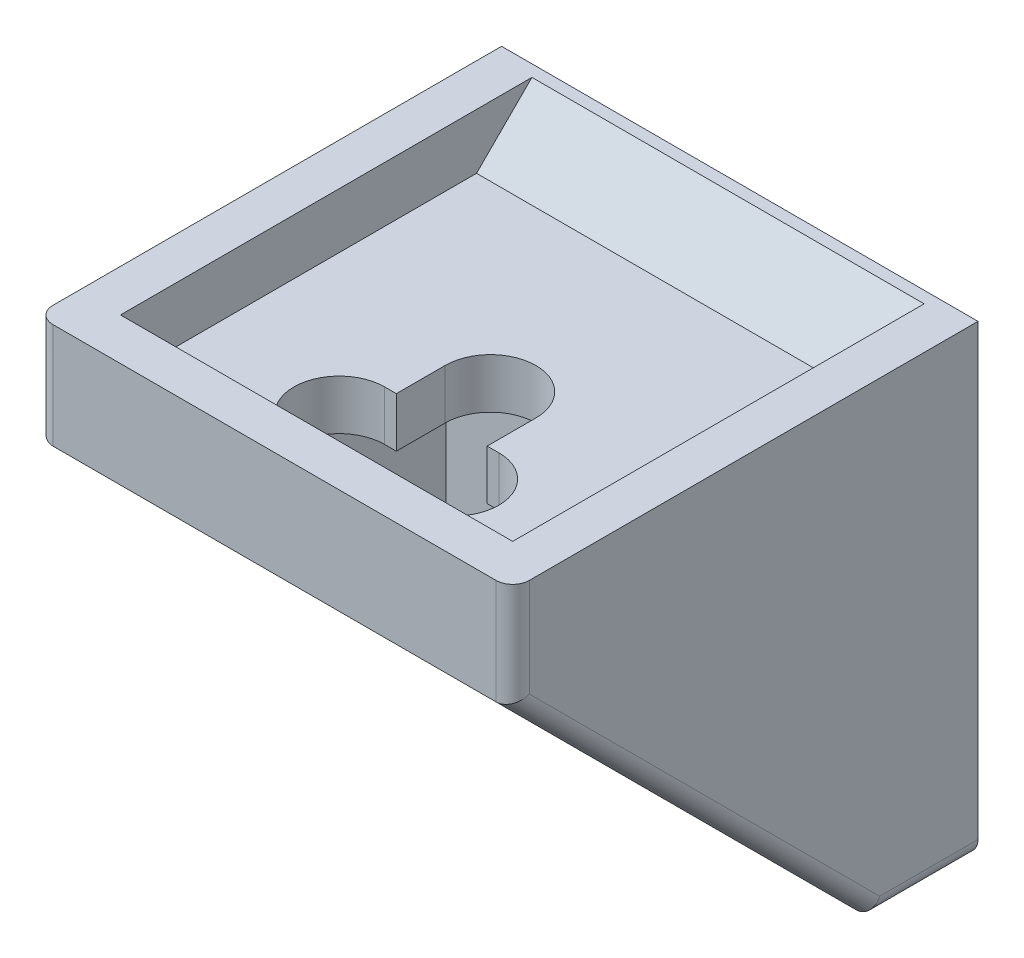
ISO-10303-21;
HEADER;
FILE_DESCRIPTION(('STEP AP214'),'2;1');
FILE_NAME('part.step','',(''),(''),'','','');
FILE_SCHEMA(('AUTOMOTIVE_DESIGN { 1 0 10303 214 1 1 1 1 }'));
ENDSEC;
DATA;
#1=APPLICATION_CONTEXT('core data for automotive mechanical design processes');
#2=APPLICATION_PROTOCOL_DEFINITION('international standard','automotive_design',2000,#1);
#3=PRODUCT_CONTEXT('',#1,'mechanical');
#4=PRODUCT('Part','Part','',(#3));
#5=PRODUCT_RELATED_PRODUCT_CATEGORY('part','',(#4));
#6=PRODUCT_DEFINITION_FORMATION('','',#4);
#7=PRODUCT_DEFINITION_CONTEXT('part definition',#1,'design');
#8=PRODUCT_DEFINITION('design','',#6,#7);
#9=PRODUCT_DEFINITION_SHAPE('','',#8);
#10=(LENGTH_UNIT() NAMED_UNIT(*) SI_UNIT(.MILLI.,.METRE.));
#11=(NAMED_UNIT(*) PLANE_ANGLE_UNIT() SI_UNIT($,.RADIAN.));
#12=(NAMED_UNIT(*) SI_UNIT($,.STERADIAN.) SOLID_ANGLE_UNIT());
#13=UNCERTAINTY_MEASURE_WITH_UNIT(LENGTH_MEASURE(1.E-05),#10,'distance_accuracy_value','');
#14=(GEOMETRIC_REPRESENTATION_CONTEXT(3) GLOBAL_UNCERTAINTY_ASSIGNED_CONTEXT((#13)) GLOBAL_UNIT_ASSIGNED_CONTEXT((#10,
#11,#12)) REPRESENTATION_CONTEXT('',''));
#15=CARTESIAN_POINT('',(0.,0.,0.));
#16=DIRECTION('',(0.,0.,1.));
#17=DIRECTION('',(1.,0.,0.));
#18=AXIS2_PLACEMENT_3D('',#15,#16,#17);
#19=CARTESIAN_POINT('',(4.1,-9.5,26.9));
#20=DIRECTION('',(0.,0.,-1.));
#21=DIRECTION('',(-1.,0.,0.));
#22=AXIS2_PLACEMENT_3D('',#19,#20,#21);
#23=PLANE('',#22);
#24=DIRECTION('',(-1.,0.,0.));
#25=VECTOR('',#24,1.);
#26=CARTESIAN_POINT('',(4.1,-5.,26.9));
#27=LINE('',#26,#25);
#28=CARTESIAN_POINT('',(4.1,-5.,26.9));
#29=VERTEX_POINT('',#28);
#30=CARTESIAN_POINT('',(5.15,-5.,26.9));
#31=VERTEX_POINT('',#30);
#32=EDGE_CURVE('E292',#29,#31,#27,.F.);
#33=ORIENTED_EDGE('',*,*,#32,.F.);
#34=DIRECTION('',(0.,1.,0.));
#35=VECTOR('',#34,1.);
#36=CARTESIAN_POINT('',(4.1,-9.5,26.9));
#37=LINE('',#36,#35);
#38=CARTESIAN_POINT('',(4.1,-9.5,26.9));
#39=VERTEX_POINT('',#38);
#40=EDGE_CURVE('E262',#29,#39,#37,.F.);
#41=ORIENTED_EDGE('',*,*,#40,.T.);
#42=DIRECTION('',(-1.,0.,0.));
#43=VECTOR('',#42,1.);
#44=CARTESIAN_POINT('',(4.1,-9.5,26.9));
#45=LINE('',#44,#43);
#46=CARTESIAN_POINT('',(5.15,-9.5,26.9));
#47=VERTEX_POINT('',#46);
#48=EDGE_CURVE('E296',#47,#39,#45,.T.);
#49=ORIENTED_EDGE('',*,*,#48,.F.);
#50=DIRECTION('',(0.,1.,0.));
#51=VECTOR('',#50,1.);
#52=CARTESIAN_POINT('',(5.15,-9.5,26.9));
#53=LINE('',#52,#51);
#54=EDGE_CURVE('E185',#47,#31,#53,.T.);
#55=ORIENTED_EDGE('',*,*,#54,.T.);
#56=EDGE_LOOP('',(#33,#41,#49,#55));
#57=FACE_BOUND('',#56,.T.);
#58=ADVANCED_FACE('F15',(#57),#23,.F.);
#59=CARTESIAN_POINT('',(-5.15,-9.5,26.9));
#60=DIRECTION('',(0.,0.,-1.));
#61=DIRECTION('',(-1.,0.,0.));
#62=AXIS2_PLACEMENT_3D('',#59,#60,#61);
#63=PLANE('',#62);
#64=DIRECTION('',(-1.,0.,0.));
#65=VECTOR('',#64,1.);
#66=CARTESIAN_POINT('',(-5.15,-5.,26.9));
#67=LINE('',#66,#65);
#68=CARTESIAN_POINT('',(-5.15,-5.,26.9));
#69=VERTEX_POINT('',#68);
#70=CARTESIAN_POINT('',(-4.1,-5.,26.9));
#71=VERTEX_POINT('',#70);
#72=EDGE_CURVE('E279',#69,#71,#67,.F.);
#73=ORIENTED_EDGE('',*,*,#72,.F.);
#74=DIRECTION('',(0.,1.,0.));
#75=VECTOR('',#74,1.);
#76=CARTESIAN_POINT('',(-5.15,-9.5,26.9));
#77=LINE('',#76,#75);
#78=CARTESIAN_POINT('',(-5.15,-9.5,26.9));
#79=VERTEX_POINT('',#78);
#80=EDGE_CURVE('E250',#69,#79,#77,.F.);
#81=ORIENTED_EDGE('',*,*,#80,.T.);
#82=DIRECTION('',(-1.,0.,0.));
#83=VECTOR('',#82,1.);
#84=CARTESIAN_POINT('',(-5.15,-9.5,26.9));
#85=LINE('',#84,#83);
#86=CARTESIAN_POINT('',(-4.1,-9.5,26.9));
#87=VERTEX_POINT('',#86);
#88=EDGE_CURVE('E288',#87,#79,#85,.T.);
#89=ORIENTED_EDGE('',*,*,#88,.F.);
#90=DIRECTION('',(0.,1.,0.));
#91=VECTOR('',#90,1.);
#92=CARTESIAN_POINT('',(-4.1,-9.5,26.9));
#93=LINE('',#92,#91);
#94=EDGE_CURVE('E255',#87,#71,#93,.T.);
#95=ORIENTED_EDGE('',*,*,#94,.T.);
#96=EDGE_LOOP('',(#73,#81,#89,#95));
#97=FACE_BOUND('',#96,.T.);
#98=ADVANCED_FACE('F650',(#97),#63,.F.);
#99=CARTESIAN_POINT('',(5.15,-26.9,9.5));
#100=DIRECTION('',(0.,1.,0.));
#101=DIRECTION('',(0.,0.,1.));
#102=AXIS2_PLACEMENT_3D('',#99,#100,#101);
#103=PLANE('',#102);
#104=DIRECTION('',(1.,0.,0.));
#105=VECTOR('',#104,1.);
#106=CARTESIAN_POINT('',(5.15,-26.9,5.));
#107=LINE('',#106,#105);
#108=CARTESIAN_POINT('',(5.15,-26.9,5.));
#109=VERTEX_POINT('',#108);
#110=CARTESIAN_POINT('',(4.1,-26.9,5.));
#111=VERTEX_POINT('',#110);
#112=EDGE_CURVE('E271',#109,#111,#107,.F.);
#113=ORIENTED_EDGE('',*,*,#112,.F.);
#114=DIRECTION('',(0.,0.,-1.));
#115=VECTOR('',#114,1.);
#116=CARTESIAN_POINT('',(5.15,-26.9,9.5));
#117=LINE('',#116,#115);
#118=CARTESIAN_POINT('',(5.15,-26.9,9.5));
#119=VERTEX_POINT('',#118);
#120=EDGE_CURVE('E236',#109,#119,#117,.F.);
#121=ORIENTED_EDGE('',*,*,#120,.T.);
#122=DIRECTION('',(1.,0.,0.));
#123=VECTOR('',#122,1.);
#124=CARTESIAN_POINT('',(5.15,-26.9,9.5));
#125=LINE('',#124,#123);
#126=CARTESIAN_POINT('',(4.1,-26.9,9.5));
#127=VERTEX_POINT('',#126);
#128=EDGE_CURVE('E277',#127,#119,#125,.T.);
#129=ORIENTED_EDGE('',*,*,#128,.F.);
#130=DIRECTION('',(0.,0.,-1.));
#131=VECTOR('',#130,1.);
#132=CARTESIAN_POINT('',(4.1,-26.9,9.5));
#133=LINE('',#132,#131);
#134=EDGE_CURVE('E233',#127,#111,#133,.T.);
#135=ORIENTED_EDGE('',*,*,#134,.T.);
#136=EDGE_LOOP('',(#113,#121,#129,#135));
#137=FACE_BOUND('',#136,.T.);
#138=ADVANCED_FACE('F795',(#137),#103,.F.);
#139=CARTESIAN_POINT('',(-4.1,-26.9,9.5));
#140=DIRECTION('',(0.,1.,0.));
#141=DIRECTION('',(0.,0.,1.));
#142=AXIS2_PLACEMENT_3D('',#139,#140,#141);
#143=PLANE('',#142);
#144=DIRECTION('',(1.,0.,0.));
#145=VECTOR('',#144,1.);
#146=CARTESIAN_POINT('',(-4.1,-26.9,5.));
#147=LINE('',#146,#145);
#148=CARTESIAN_POINT('',(-4.1,-26.9,5.));
#149=VERTEX_POINT('',#148);
#150=CARTESIAN_POINT('',(-5.15,-26.9,5.));
#151=VERTEX_POINT('',#150);
#152=EDGE_CURVE('E195',#149,#151,#147,.F.);
#153=ORIENTED_EDGE('',*,*,#152,.F.);
#154=DIRECTION('',(0.,0.,1.));
#155=VECTOR('',#154,1.);
#156=CARTESIAN_POINT('',(-4.1,-26.9,9.5));
#157=LINE('',#156,#155);
#158=CARTESIAN_POINT('',(-4.1,-26.9,9.5));
#159=VERTEX_POINT('',#158);
#160=EDGE_CURVE('E224',#149,#159,#157,.T.);
#161=ORIENTED_EDGE('',*,*,#160,.T.);
#162=DIRECTION('',(1.,0.,0.));
#163=VECTOR('',#162,1.);
#164=CARTESIAN_POINT('',(-4.1,-26.9,9.5));
#165=LINE('',#164,#163);
#166=CARTESIAN_POINT('',(-5.15,-26.9,9.5));
#167=VERTEX_POINT('',#166);
#168=EDGE_CURVE('E268',#167,#159,#165,.T.);
#169=ORIENTED_EDGE('',*,*,#168,.F.);
#170=DIRECTION('',(0.,0.,-1.));
#171=VECTOR('',#170,1.);
#172=CARTESIAN_POINT('',(-5.15,-26.9,9.5));
#173=LINE('',#172,#171);
#174=EDGE_CURVE('E219',#167,#151,#173,.T.);
#175=ORIENTED_EDGE('',*,*,#174,.T.);
#176=EDGE_LOOP('',(#153,#161,#169,#175));
#177=FACE_BOUND('',#176,.T.);
#178=ADVANCED_FACE('F791',(#177),#143,.F.);
#179=CARTESIAN_POINT('',(5.15,-9.5,35.1));
#180=DIRECTION('',(0.,0.,1.));
#181=DIRECTION('',(1.,0.,0.));
#182=AXIS2_PLACEMENT_3D('',#179,#180,#181);
#183=PLANE('',#182);
#184=DIRECTION('',(1.,0.,0.));
#185=VECTOR('',#184,1.);
#186=CARTESIAN_POINT('',(-17.7,-5.,35.1));
#187=LINE('',#186,#185);
#188=CARTESIAN_POINT('',(-5.15,-5.,35.1));
#189=VERTEX_POINT('',#188);
#190=CARTESIAN_POINT('',(5.15,-5.,35.1));
#191=VERTEX_POINT('',#190);
#192=EDGE_CURVE('E187',#189,#191,#187,.T.);
#193=ORIENTED_EDGE('',*,*,#192,.T.);
#194=DIRECTION('',(0.,1.,0.));
#195=VECTOR('',#194,1.);
#196=CARTESIAN_POINT('',(5.15,-9.5,35.1));
#197=LINE('',#196,#195);
#198=CARTESIAN_POINT('',(5.15,-9.5,35.1));
#199=VERTEX_POINT('',#198);
#200=EDGE_CURVE('E182',#191,#199,#197,.F.);
#201=ORIENTED_EDGE('',*,*,#200,.T.);
#202=DIRECTION('',(1.,0.,0.));
#203=VECTOR('',#202,1.);
#204=CARTESIAN_POINT('',(-17.,-9.5,35.1));
#205=LINE('',#204,#203);
#206=CARTESIAN_POINT('',(-5.15,-9.5,35.1));
#207=VERTEX_POINT('',#206);
#208=EDGE_CURVE('E194',#199,#207,#205,.F.);
#209=ORIENTED_EDGE('',*,*,#208,.T.);
#210=DIRECTION('',(0.,1.,0.));
#211=VECTOR('',#210,1.);
#212=CARTESIAN_POINT('',(-5.15,-9.5,35.1));
#213=LINE('',#212,#211);
#214=EDGE_CURVE('E241',#207,#189,#213,.T.);
#215=ORIENTED_EDGE('',*,*,#214,.T.);
#216=EDGE_LOOP('',(#193,#201,#209,#215));
#217=FACE_BOUND('',#216,.T.);
#218=ADVANCED_FACE('F192',(#217),#183,.F.);
#219=CARTESIAN_POINT('',(5.15,-9.5,31.));
#220=DIRECTION('',(0.,1.,0.));
#221=DIRECTION('',(0.,0.,1.));
#222=AXIS2_PLACEMENT_3D('',#219,#220,#221);
#223=CYLINDRICAL_SURFACE('',#222,4.1);
#224=CARTESIAN_POINT('',(5.15,-5.,31.));
#225=DIRECTION('',(0.,1.,0.));
#226=DIRECTION('',(0.,0.,1.));
#227=AXIS2_PLACEMENT_3D('',#224,#225,#226);
#228=CIRCLE('',#227,4.1);
#229=EDGE_CURVE('E366',#191,#31,#228,.T.);
#230=ORIENTED_EDGE('',*,*,#229,.T.);
#231=ORIENTED_EDGE('',*,*,#54,.F.);
#232=CARTESIAN_POINT('',(5.15,-9.5,31.));
#233=DIRECTION('',(0.,1.,0.));
#234=DIRECTION('',(0.,0.,1.));
#235=AXIS2_PLACEMENT_3D('',#232,#233,#234);
#236=CIRCLE('',#235,4.1);
#237=EDGE_CURVE('E178',#47,#199,#236,.F.);
#238=ORIENTED_EDGE('',*,*,#237,.T.);
#239=ORIENTED_EDGE('',*,*,#200,.F.);
#240=EDGE_LOOP('',(#230,#231,#238,#239));
#241=FACE_BOUND('',#240,.T.);
#242=ADVANCED_FACE('F181',(#241),#223,.F.);
#243=CARTESIAN_POINT('',(4.1,-9.5,22.5));
#244=DIRECTION('',(1.,0.,0.));
#245=DIRECTION('',(0.,0.,-1.));
#246=AXIS2_PLACEMENT_3D('',#243,#244,#245);
#247=PLANE('',#246);
#248=DIRECTION('',(0.,0.,-1.));
#249=VECTOR('',#248,1.);
#250=CARTESIAN_POINT('',(4.1,-5.,6.06066017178));
#251=LINE('',#250,#249);
#252=CARTESIAN_POINT('',(4.1,-5.,22.5));
#253=VERTEX_POINT('',#252);
#254=EDGE_CURVE('E365',#29,#253,#251,.T.);
#255=ORIENTED_EDGE('',*,*,#254,.T.);
#256=DIRECTION('',(0.,1.,0.));
#257=VECTOR('',#256,1.);
#258=CARTESIAN_POINT('',(4.1,-9.5,22.5));
#259=LINE('',#258,#257);
#260=CARTESIAN_POINT('',(4.1,-9.5,22.5));
#261=VERTEX_POINT('',#260);
#262=EDGE_CURVE('E258',#253,#261,#259,.F.);
#263=ORIENTED_EDGE('',*,*,#262,.T.);
#264=DIRECTION('',(0.,0.,1.));
#265=VECTOR('',#264,1.);
#266=CARTESIAN_POINT('',(4.1,-9.5,42.));
#267=LINE('',#266,#265);
#268=EDGE_CURVE('E188',#261,#39,#267,.T.);
#269=ORIENTED_EDGE('',*,*,#268,.T.);
#270=ORIENTED_EDGE('',*,*,#40,.F.);
#271=EDGE_LOOP('',(#255,#263,#269,#270));
#272=FACE_BOUND('',#271,.T.);
#273=ADVANCED_FACE('F639',(#272),#247,.F.);
#274=CARTESIAN_POINT('',(0.,-9.5,22.5));
#275=DIRECTION('',(0.,1.,0.));
#276=DIRECTION('',(0.,0.,1.));
#277=AXIS2_PLACEMENT_3D('',#274,#275,#276);
#278=CYLINDRICAL_SURFACE('',#277,4.1);
#279=CARTESIAN_POINT('',(0.,-5.,22.5));
#280=DIRECTION('',(0.,1.,0.));
#281=DIRECTION('',(0.,0.,1.));
#282=AXIS2_PLACEMENT_3D('',#279,#280,#281);
#283=CIRCLE('',#282,4.1);
#284=CARTESIAN_POINT('',(-4.1,-5.,22.5));
#285=VERTEX_POINT('',#284);
#286=EDGE_CURVE('E362',#253,#285,#283,.T.);
#287=ORIENTED_EDGE('',*,*,#286,.T.);
#288=DIRECTION('',(0.,1.,0.));
#289=VECTOR('',#288,1.);
#290=CARTESIAN_POINT('',(-4.1,-9.5,22.5));
#291=LINE('',#290,#289);
#292=CARTESIAN_POINT('',(-4.1,-9.5,22.5));
#293=VERTEX_POINT('',#292);
#294=EDGE_CURVE('E253',#285,#293,#291,.F.);
#295=ORIENTED_EDGE('',*,*,#294,.T.);
#296=CARTESIAN_POINT('',(0.,-9.5,22.5));
#297=DIRECTION('',(0.,1.,0.));
#298=DIRECTION('',(0.,0.,1.));
#299=AXIS2_PLACEMENT_3D('',#296,#297,#298);
#300=CIRCLE('',#299,4.1);
#301=EDGE_CURVE('E367',#293,#261,#300,.F.);
#302=ORIENTED_EDGE('',*,*,#301,.T.);
#303=ORIENTED_EDGE('',*,*,#262,.F.);
#304=EDGE_LOOP('',(#287,#295,#302,#303));
#305=FACE_BOUND('',#304,.T.);
#306=ADVANCED_FACE('F641',(#305),#278,.F.);
#307=CARTESIAN_POINT('',(-4.1,-9.5,26.9));
#308=DIRECTION('',(-1.,0.,0.));
#309=DIRECTION('',(0.,0.,1.));
#310=AXIS2_PLACEMENT_3D('',#307,#308,#309);
#311=PLANE('',#310);
#312=DIRECTION('',(0.,0.,-1.));
#313=VECTOR('',#312,1.);
#314=CARTESIAN_POINT('',(-4.1,-5.,6.06066017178));
#315=LINE('',#314,#313);
#316=EDGE_CURVE('E361',#285,#71,#315,.F.);
#317=ORIENTED_EDGE('',*,*,#316,.T.);
#318=ORIENTED_EDGE('',*,*,#94,.F.);
#319=DIRECTION('',(0.,0.,1.));
#320=VECTOR('',#319,1.);
#321=CARTESIAN_POINT('',(-4.1,-9.5,42.));
#322=LINE('',#321,#320);
#323=EDGE_CURVE('E201',#87,#293,#322,.F.);
#324=ORIENTED_EDGE('',*,*,#323,.T.);
#325=ORIENTED_EDGE('',*,*,#294,.F.);
#326=EDGE_LOOP('',(#317,#318,#324,#325));
#327=FACE_BOUND('',#326,.T.);
#328=ADVANCED_FACE('F647',(#327),#311,.F.);
#329=CARTESIAN_POINT('',(-5.15,-9.5,31.));
#330=DIRECTION('',(0.,1.,0.));
#331=DIRECTION('',(0.,0.,1.));
#332=AXIS2_PLACEMENT_3D('',#329,#330,#331);
#333=CYLINDRICAL_SURFACE('',#332,4.1);
#334=CARTESIAN_POINT('',(-5.15,-5.,31.));
#335=DIRECTION('',(0.,1.,0.));
#336=DIRECTION('',(0.,0.,1.));
#337=AXIS2_PLACEMENT_3D('',#334,#335,#336);
#338=CIRCLE('',#337,4.1);
#339=EDGE_CURVE('E358',#69,#189,#338,.T.);
#340=ORIENTED_EDGE('',*,*,#339,.T.);
#341=ORIENTED_EDGE('',*,*,#214,.F.);
#342=CARTESIAN_POINT('',(-5.15,-9.5,31.));
#343=DIRECTION('',(0.,1.,0.));
#344=DIRECTION('',(0.,0.,1.));
#345=AXIS2_PLACEMENT_3D('',#342,#343,#344);
#346=CIRCLE('',#345,4.1);
#347=EDGE_CURVE('E18',#207,#79,#346,.F.);
#348=ORIENTED_EDGE('',*,*,#347,.T.);
#349=ORIENTED_EDGE('',*,*,#80,.F.);
#350=EDGE_LOOP('',(#340,#341,#348,#349));
#351=FACE_BOUND('',#350,.T.);
#352=ADVANCED_FACE('F652',(#351),#333,.F.);
#353=CARTESIAN_POINT('',(5.15,-31.,9.5));
#354=DIRECTION('',(0.,0.,-1.));
#355=DIRECTION('',(-1.,0.,0.));
#356=AXIS2_PLACEMENT_3D('',#353,#354,#355);
#357=CYLINDRICAL_SURFACE('',#356,4.1);
#358=CARTESIAN_POINT('',(5.15,-31.,9.5));
#359=DIRECTION('',(0.,0.,-1.));
#360=DIRECTION('',(-1.,0.,0.));
#361=AXIS2_PLACEMENT_3D('',#358,#359,#360);
#362=CIRCLE('',#361,4.1);
#363=CARTESIAN_POINT('',(5.15,-35.1,9.5));
#364=VERTEX_POINT('',#363);
#365=EDGE_CURVE('E343',#364,#119,#362,.F.);
#366=ORIENTED_EDGE('',*,*,#365,.T.);
#367=ORIENTED_EDGE('',*,*,#120,.F.);
#368=CARTESIAN_POINT('',(5.15,-31.,5.));
#369=DIRECTION('',(0.,0.,-1.));
#370=DIRECTION('',(-1.,0.,0.));
#371=AXIS2_PLACEMENT_3D('',#368,#369,#370);
#372=CIRCLE('',#371,4.1);
#373=CARTESIAN_POINT('',(5.15,-35.1,5.));
#374=VERTEX_POINT('',#373);
#375=EDGE_CURVE('E355',#109,#374,#372,.T.);
#376=ORIENTED_EDGE('',*,*,#375,.T.);
#377=DIRECTION('',(0.,0.,-1.));
#378=VECTOR('',#377,1.);
#379=CARTESIAN_POINT('',(5.15,-35.1,9.5));
#380=LINE('',#379,#378);
#381=EDGE_CURVE('E211',#374,#364,#380,.F.);
#382=ORIENTED_EDGE('',*,*,#381,.T.);
#383=EDGE_LOOP('',(#366,#367,#376,#382));
#384=FACE_BOUND('',#383,.T.);
#385=ADVANCED_FACE('F654',(#384),#357,.F.);
#386=CARTESIAN_POINT('',(4.1,-26.9,9.5));
#387=DIRECTION('',(1.,0.,0.));
#388=DIRECTION('',(0.,0.,-1.));
#389=AXIS2_PLACEMENT_3D('',#386,#387,#388);
#390=PLANE('',#389);
#391=DIRECTION('',(0.,1.,0.));
#392=VECTOR('',#391,1.);
#393=CARTESIAN_POINT('',(4.1,-38.2,5.));
#394=LINE('',#393,#392);
#395=CARTESIAN_POINT('',(4.1,-22.5,5.));
#396=VERTEX_POINT('',#395);
#397=EDGE_CURVE('E349',#396,#111,#394,.F.);
#398=ORIENTED_EDGE('',*,*,#397,.T.);
#399=ORIENTED_EDGE('',*,*,#134,.F.);
#400=DIRECTION('',(0.,1.,0.));
#401=VECTOR('',#400,1.);
#402=CARTESIAN_POINT('',(4.1,-9.5,9.5));
#403=LINE('',#402,#401);
#404=CARTESIAN_POINT('',(4.1,-22.5,9.5));
#405=VERTEX_POINT('',#404);
#406=EDGE_CURVE('E342',#127,#405,#403,.T.);
#407=ORIENTED_EDGE('',*,*,#406,.T.);
#408=DIRECTION('',(0.,0.,-1.));
#409=VECTOR('',#408,1.);
#410=CARTESIAN_POINT('',(4.1,-22.5,9.5));
#411=LINE('',#410,#409);
#412=EDGE_CURVE('E227',#405,#396,#411,.T.);
#413=ORIENTED_EDGE('',*,*,#412,.T.);
#414=EDGE_LOOP('',(#398,#399,#407,#413));
#415=FACE_BOUND('',#414,.T.);
#416=ADVANCED_FACE('F661',(#415),#390,.F.);
#417=CARTESIAN_POINT('',(0.,-22.5,9.5));
#418=DIRECTION('',(0.,0.,-1.));
#419=DIRECTION('',(-1.,0.,0.));
#420=AXIS2_PLACEMENT_3D('',#417,#418,#419);
#421=CYLINDRICAL_SURFACE('',#420,4.1);
#422=CARTESIAN_POINT('',(0.,-22.5,5.));
#423=DIRECTION('',(0.,0.,-1.));
#424=DIRECTION('',(-1.,0.,0.));
#425=AXIS2_PLACEMENT_3D('',#422,#423,#424);
#426=CIRCLE('',#425,4.1);
#427=CARTESIAN_POINT('',(-4.1,-22.5,5.));
#428=VERTEX_POINT('',#427);
#429=EDGE_CURVE('E346',#428,#396,#426,.T.);
#430=ORIENTED_EDGE('',*,*,#429,.T.);
#431=ORIENTED_EDGE('',*,*,#412,.F.);
#432=CARTESIAN_POINT('',(0.,-22.5,9.5));
#433=DIRECTION('',(0.,0.,-1.));
#434=DIRECTION('',(-1.,0.,0.));
#435=AXIS2_PLACEMENT_3D('',#432,#433,#434);
#436=CIRCLE('',#435,4.1);
#437=CARTESIAN_POINT('',(-4.1,-22.5,9.5));
#438=VERTEX_POINT('',#437);
#439=EDGE_CURVE('E339',#405,#438,#436,.F.);
#440=ORIENTED_EDGE('',*,*,#439,.T.);
#441=DIRECTION('',(0.,0.,1.));
#442=VECTOR('',#441,1.);
#443=CARTESIAN_POINT('',(-4.1,-22.5,9.5));
#444=LINE('',#443,#442);
#445=EDGE_CURVE('E225',#438,#428,#444,.F.);
#446=ORIENTED_EDGE('',*,*,#445,.T.);
#447=EDGE_LOOP('',(#430,#431,#440,#446));
#448=FACE_BOUND('',#447,.T.);
#449=ADVANCED_FACE('F768',(#448),#421,.F.);
#450=CARTESIAN_POINT('',(-4.1,-22.5,9.5));
#451=DIRECTION('',(-1.,0.,0.));
#452=DIRECTION('',(0.,0.,1.));
#453=AXIS2_PLACEMENT_3D('',#450,#451,#452);
#454=PLANE('',#453);
#455=DIRECTION('',(0.,1.,0.));
#456=VECTOR('',#455,1.);
#457=CARTESIAN_POINT('',(-4.1,-38.2,5.));
#458=LINE('',#457,#456);
#459=EDGE_CURVE('E350',#149,#428,#458,.T.);
#460=ORIENTED_EDGE('',*,*,#459,.T.);
#461=ORIENTED_EDGE('',*,*,#445,.F.);
#462=DIRECTION('',(0.,1.,0.));
#463=VECTOR('',#462,1.);
#464=CARTESIAN_POINT('',(-4.1,-9.5,9.5));
#465=LINE('',#464,#463);
#466=EDGE_CURVE('E338',#438,#159,#465,.F.);
#467=ORIENTED_EDGE('',*,*,#466,.T.);
#468=ORIENTED_EDGE('',*,*,#160,.F.);
#469=EDGE_LOOP('',(#460,#461,#467,#468));
#470=FACE_BOUND('',#469,.T.);
#471=ADVANCED_FACE('F764',(#470),#454,.F.);
#472=CARTESIAN_POINT('',(-5.15,-31.,9.5));
#473=DIRECTION('',(0.,0.,-1.));
#474=DIRECTION('',(-1.,0.,0.));
#475=AXIS2_PLACEMENT_3D('',#472,#473,#474);
#476=CYLINDRICAL_SURFACE('',#475,4.1);
#477=CARTESIAN_POINT('',(-5.15,-31.,9.5));
#478=DIRECTION('',(0.,0.,-1.));
#479=DIRECTION('',(-1.,0.,0.));
#480=AXIS2_PLACEMENT_3D('',#477,#478,#479);
#481=CIRCLE('',#480,4.1);
#482=CARTESIAN_POINT('',(-5.15,-35.1,9.5));
#483=VERTEX_POINT('',#482);
#484=EDGE_CURVE('E334',#167,#483,#481,.F.);
#485=ORIENTED_EDGE('',*,*,#484,.T.);
#486=DIRECTION('',(0.,0.,-1.));
#487=VECTOR('',#486,1.);
#488=CARTESIAN_POINT('',(-5.15,-35.1,9.5));
#489=LINE('',#488,#487);
#490=CARTESIAN_POINT('',(-5.15,-35.1,5.));
#491=VERTEX_POINT('',#490);
#492=EDGE_CURVE('E216',#483,#491,#489,.T.);
#493=ORIENTED_EDGE('',*,*,#492,.T.);
#494=CARTESIAN_POINT('',(-5.15,-31.,5.));
#495=DIRECTION('',(0.,0.,-1.));
#496=DIRECTION('',(-1.,0.,0.));
#497=AXIS2_PLACEMENT_3D('',#494,#495,#496);
#498=CIRCLE('',#497,4.1);
#499=EDGE_CURVE('E351',#491,#151,#498,.T.);
#500=ORIENTED_EDGE('',*,*,#499,.T.);
#501=ORIENTED_EDGE('',*,*,#174,.F.);
#502=EDGE_LOOP('',(#485,#493,#500,#501));
#503=FACE_BOUND('',#502,.T.);
#504=ADVANCED_FACE('F760',(#503),#476,.F.);
#505=CARTESIAN_POINT('',(-5.15,-35.1,9.5));
#506=DIRECTION('',(0.,-1.,0.));
#507=DIRECTION('',(0.,0.,-1.));
#508=AXIS2_PLACEMENT_3D('',#505,#506,#507);
#509=PLANE('',#508);
#510=DIRECTION('',(1.,0.,0.));
#511=VECTOR('',#510,1.);
#512=CARTESIAN_POINT('',(-17.7,-35.1,5.));
#513=LINE('',#512,#511);
#514=EDGE_CURVE('E354',#374,#491,#513,.F.);
#515=ORIENTED_EDGE('',*,*,#514,.T.);
#516=ORIENTED_EDGE('',*,*,#492,.F.);
#517=DIRECTION('',(-1.,0.,0.));
#518=VECTOR('',#517,1.);
#519=CARTESIAN_POINT('',(-17.,-35.1,9.5));
#520=LINE('',#519,#518);
#521=EDGE_CURVE('E337',#483,#364,#520,.F.);
#522=ORIENTED_EDGE('',*,*,#521,.T.);
#523=ORIENTED_EDGE('',*,*,#381,.F.);
#524=EDGE_LOOP('',(#515,#516,#522,#523));
#525=FACE_BOUND('',#524,.T.);
#526=ADVANCED_FACE('F757',(#525),#509,.F.);
#527=CARTESIAN_POINT('',(-17.,0.,0.));
#528=DIRECTION('',(-1.,0.,0.));
#529=DIRECTION('',(0.,0.,1.));
#530=AXIS2_PLACEMENT_3D('',#527,#528,#529);
#531=PLANE('',#530);
#532=DIRECTION('',(0.,0.,1.));
#533=VECTOR('',#532,1.);
#534=CARTESIAN_POINT('',(-17.,-9.5,42.));
#535=LINE('',#534,#533);
#536=CARTESIAN_POINT('',(-17.,-9.5,9.5));
#537=VERTEX_POINT('',#536);
#538=CARTESIAN_POINT('',(-17.,-9.5,42.));
#539=VERTEX_POINT('',#538);
#540=EDGE_CURVE('E199',#537,#539,#535,.T.);
#541=ORIENTED_EDGE('',*,*,#540,.T.);
#542=DIRECTION('',(0.,-0.707106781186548,-0.707106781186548));
#543=VECTOR('',#542,1.);
#544=CARTESIAN_POINT('',(-17.,-42.,9.5));
#545=LINE('',#544,#543);
#546=CARTESIAN_POINT('',(-17.,-42.,9.5));
#547=VERTEX_POINT('',#546);
#548=EDGE_CURVE('E436',#547,#539,#545,.F.);
#549=ORIENTED_EDGE('',*,*,#548,.F.);
#550=DIRECTION('',(0.,1.,0.));
#551=VECTOR('',#550,1.);
#552=CARTESIAN_POINT('',(-17.,-9.5,9.5));
#553=LINE('',#552,#551);
#554=EDGE_CURVE('E246',#547,#537,#553,.T.);
#555=ORIENTED_EDGE('',*,*,#554,.T.);
#556=EDGE_LOOP('',(#541,#549,#555));
#557=FACE_BOUND('',#556,.T.);
#558=ADVANCED_FACE('F615',(#557),#531,.F.);
#559=CARTESIAN_POINT('',(17.,0.,0.));
#560=DIRECTION('',(-1.,0.,0.));
#561=DIRECTION('',(0.,0.,1.));
#562=AXIS2_PLACEMENT_3D('',#559,#560,#561);
#563=PLANE('',#562);
#564=DIRECTION('',(0.,1.,0.));
#565=VECTOR('',#564,1.);
#566=CARTESIAN_POINT('',(17.,-9.5,9.5));
#567=LINE('',#566,#565);
#568=CARTESIAN_POINT('',(17.,-9.5,9.5));
#569=VERTEX_POINT('',#568);
#570=CARTESIAN_POINT('',(17.,-42.,9.5));
#571=VERTEX_POINT('',#570);
#572=EDGE_CURVE('E245',#569,#571,#567,.F.);
#573=ORIENTED_EDGE('',*,*,#572,.T.);
#574=DIRECTION('',(0.,-0.707106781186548,-0.707106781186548));
#575=VECTOR('',#574,1.);
#576=CARTESIAN_POINT('',(17.,-42.,9.5));
#577=LINE('',#576,#575);
#578=CARTESIAN_POINT('',(17.,-9.5,42.));
#579=VERTEX_POINT('',#578);
#580=EDGE_CURVE('E390',#579,#571,#577,.T.);
#581=ORIENTED_EDGE('',*,*,#580,.F.);
#582=DIRECTION('',(0.,0.,1.));
#583=VECTOR('',#582,1.);
#584=CARTESIAN_POINT('',(17.,-9.5,42.));
#585=LINE('',#584,#583);
#586=EDGE_CURVE('E203',#579,#569,#585,.F.);
#587=ORIENTED_EDGE('',*,*,#586,.T.);
#588=EDGE_LOOP('',(#573,#581,#587));
#589=FACE_BOUND('',#588,.T.);
#590=ADVANCED_FACE('F606',(#589),#563,.T.);
#591=CARTESIAN_POINT('',(-17.,-9.5,42.));
#592=DIRECTION('',(0.,1.,0.));
#593=DIRECTION('',(0.,0.,1.));
#594=AXIS2_PLACEMENT_3D('',#591,#592,#593);
#595=PLANE('',#594);
#596=ORIENTED_EDGE('',*,*,#48,.T.);
#597=ORIENTED_EDGE('',*,*,#268,.F.);
#598=ORIENTED_EDGE('',*,*,#301,.F.);
#599=ORIENTED_EDGE('',*,*,#323,.F.);
#600=ORIENTED_EDGE('',*,*,#88,.T.);
#601=ORIENTED_EDGE('',*,*,#347,.F.);
#602=ORIENTED_EDGE('',*,*,#208,.F.);
#603=ORIENTED_EDGE('',*,*,#237,.F.);
#604=EDGE_LOOP('',(#596,#597,#598,#599,#600,#601,#602,#603));
#605=FACE_BOUND('',#604,.T.);
#606=DIRECTION('',(-1.,0.,0.));
#607=VECTOR('',#606,1.);
#608=CARTESIAN_POINT('',(-17.,-9.5,9.5));
#609=LINE('',#608,#607);
#610=EDGE_CURVE('E242',#537,#569,#609,.F.);
#611=ORIENTED_EDGE('',*,*,#610,.T.);
#612=ORIENTED_EDGE('',*,*,#586,.F.);
#613=DIRECTION('',(1.,0.,0.));
#614=VECTOR('',#613,1.);
#615=CARTESIAN_POINT('',(21.5,-9.5,42.));
#616=LINE('',#615,#614);
#617=EDGE_CURVE('E382',#539,#579,#616,.T.);
#618=ORIENTED_EDGE('',*,*,#617,.F.);
#619=ORIENTED_EDGE('',*,*,#540,.F.);
#620=EDGE_LOOP('',(#611,#612,#618,#619));
#621=FACE_BOUND('',#620,.T.);
#622=ADVANCED_FACE('F197',(#605,#621),#595,.F.);
#623=CARTESIAN_POINT('',(-17.7,-5.,6.06066017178));
#624=DIRECTION('',(0.,-1.,0.));
#625=DIRECTION('',(0.,0.,-1.));
#626=AXIS2_PLACEMENT_3D('',#623,#624,#625);
#627=PLANE('',#626);
#628=ORIENTED_EDGE('',*,*,#339,.F.);
#629=ORIENTED_EDGE('',*,*,#72,.T.);
#630=ORIENTED_EDGE('',*,*,#316,.F.);
#631=ORIENTED_EDGE('',*,*,#286,.F.);
#632=ORIENTED_EDGE('',*,*,#254,.F.);
#633=ORIENTED_EDGE('',*,*,#32,.T.);
#634=ORIENTED_EDGE('',*,*,#229,.F.);
#635=ORIENTED_EDGE('',*,*,#192,.F.);
#636=EDGE_LOOP('',(#628,#629,#630,#631,#632,#633,#634,#635));
#637=FACE_BOUND('',#636,.T.);
#638=DIRECTION('',(0.,0.,1.));
#639=VECTOR('',#638,1.);
#640=CARTESIAN_POINT('',(17.7,-5.,0.));
#641=LINE('',#640,#639);
#642=CARTESIAN_POINT('',(17.7,-5.,6.06066017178));
#643=VERTEX_POINT('',#642);
#644=CARTESIAN_POINT('',(17.7,-5.,38.2));
#645=VERTEX_POINT('',#644);
#646=EDGE_CURVE('E465',#643,#645,#641,.T.);
#647=ORIENTED_EDGE('',*,*,#646,.F.);
#648=DIRECTION('',(1.,0.,0.));
#649=VECTOR('',#648,1.);
#650=CARTESIAN_POINT('',(-17.7,-5.,6.06066017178));
#651=LINE('',#650,#649);
#652=CARTESIAN_POINT('',(-17.7,-5.,6.06066017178));
#653=VERTEX_POINT('',#652);
#654=EDGE_CURVE('E459',#643,#653,#651,.F.);
#655=ORIENTED_EDGE('',*,*,#654,.T.);
#656=DIRECTION('',(0.,0.,1.));
#657=VECTOR('',#656,1.);
#658=CARTESIAN_POINT('',(-17.7,-5.,0.));
#659=LINE('',#658,#657);
#660=CARTESIAN_POINT('',(-17.7,-5.,38.2));
#661=VERTEX_POINT('',#660);
#662=EDGE_CURVE('E477',#653,#661,#659,.T.);
#663=ORIENTED_EDGE('',*,*,#662,.T.);
#664=DIRECTION('',(1.,0.,0.));
#665=VECTOR('',#664,1.);
#666=CARTESIAN_POINT('',(-17.7,-5.,38.2));
#667=LINE('',#666,#665);
#668=EDGE_CURVE('E468',#661,#645,#667,.T.);
#669=ORIENTED_EDGE('',*,*,#668,.T.);
#670=EDGE_LOOP('',(#647,#655,#663,#669));
#671=FACE_BOUND('',#670,.T.);
#672=ADVANCED_FACE('F644',(#637,#671),#627,.F.);
#673=CARTESIAN_POINT('',(-20.,-40.94598371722,8.432695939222));
#674=DIRECTION('',(0.,-0.707106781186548,-0.707106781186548));
#675=DIRECTION('',(0.,0.707106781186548,-0.707106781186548));
#676=AXIS2_PLACEMENT_3D('',#673,#674,#675);
#677=CYLINDRICAL_SURFACE('',#676,1.5);
#678=CARTESIAN_POINT('',(-20.,-8.878679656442,40.5));
#679=DIRECTION('',(0.,-0.923879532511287,-0.38268343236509));
#680=DIRECTION('',(0.,-0.38268343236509,0.923879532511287));
#681=AXIS2_PLACEMENT_3D('',#678,#679,#680);
#682=ELLIPSE('',#681,1.62358830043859,1.5);
#683=CARTESIAN_POINT('',(-21.5,-8.87867965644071,40.4999999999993));
#684=VERTEX_POINT('',#683);
#685=CARTESIAN_POINT('',(-20.,-9.50000000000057,41.9999999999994));
#686=VERTEX_POINT('',#685);
#687=EDGE_CURVE('E329',#684,#686,#682,.F.);
#688=ORIENTED_EDGE('',*,*,#687,.F.);
#689=DIRECTION('',(0.,0.707106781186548,0.707106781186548));
#690=VECTOR('',#689,1.);
#691=CARTESIAN_POINT('',(-21.5,-40.5,8.87867965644));
#692=LINE('',#691,#690);
#693=CARTESIAN_POINT('',(-21.5,-40.5,8.878679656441));
#694=VERTEX_POINT('',#693);
#695=EDGE_CURVE('E400',#694,#684,#692,.T.);
#696=ORIENTED_EDGE('',*,*,#695,.F.);
#697=CARTESIAN_POINT('',(-20.,-40.5,8.878679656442));
#698=DIRECTION('',(0.,-0.38268343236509,-0.923879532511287));
#699=DIRECTION('',(0.,0.923879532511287,-0.38268343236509));
#700=AXIS2_PLACEMENT_3D('',#697,#698,#699);
#701=ELLIPSE('',#700,1.62358830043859,1.5);
#702=CARTESIAN_POINT('',(-20.,-41.9999999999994,9.50000000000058));
#703=VERTEX_POINT('',#702);
#704=EDGE_CURVE('E325',#703,#694,#701,.T.);
#705=ORIENTED_EDGE('',*,*,#704,.F.);
#706=DIRECTION('',(0.,-0.707106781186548,-0.707106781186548));
#707=VECTOR('',#706,1.);
#708=CARTESIAN_POINT('',(-20.,-42.,9.5));
#709=LINE('',#708,#707);
#710=EDGE_CURVE('E417',#686,#703,#709,.T.);
#711=ORIENTED_EDGE('',*,*,#710,.F.);
#712=EDGE_LOOP('',(#688,#696,#705,#711));
#713=FACE_BOUND('',#712,.T.);
#714=ADVANCED_FACE('F744',(#713),#677,.T.);
#715=CARTESIAN_POINT('',(-17.7,-38.2,5.));
#716=DIRECTION('',(0.,0.,1.));
#717=DIRECTION('',(1.,0.,0.));
#718=AXIS2_PLACEMENT_3D('',#715,#716,#717);
#719=PLANE('',#718);
#720=ORIENTED_EDGE('',*,*,#397,.F.);
#721=ORIENTED_EDGE('',*,*,#429,.F.);
#722=ORIENTED_EDGE('',*,*,#459,.F.);
#723=ORIENTED_EDGE('',*,*,#152,.T.);
#724=ORIENTED_EDGE('',*,*,#499,.F.);
#725=ORIENTED_EDGE('',*,*,#514,.F.);
#726=ORIENTED_EDGE('',*,*,#375,.F.);
#727=ORIENTED_EDGE('',*,*,#112,.T.);
#728=EDGE_LOOP('',(#720,#721,#722,#723,#724,#725,#726,#727));
#729=FACE_BOUND('',#728,.T.);
#730=DIRECTION('',(0.,1.,0.));
#731=VECTOR('',#730,1.);
#732=CARTESIAN_POINT('',(17.7,0.,5.));
#733=LINE('',#732,#731);
#734=CARTESIAN_POINT('',(17.7,-38.2,5.));
#735=VERTEX_POINT('',#734);
#736=CARTESIAN_POINT('',(17.7,-6.06066017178,5.));
#737=VERTEX_POINT('',#736);
#738=EDGE_CURVE('E491',#735,#737,#733,.T.);
#739=ORIENTED_EDGE('',*,*,#738,.F.);
#740=DIRECTION('',(1.,0.,0.));
#741=VECTOR('',#740,1.);
#742=CARTESIAN_POINT('',(-17.7,-38.2,5.));
#743=LINE('',#742,#741);
#744=CARTESIAN_POINT('',(-17.7,-38.2,5.));
#745=VERTEX_POINT('',#744);
#746=EDGE_CURVE('E485',#735,#745,#743,.F.);
#747=ORIENTED_EDGE('',*,*,#746,.T.);
#748=DIRECTION('',(0.,1.,0.));
#749=VECTOR('',#748,1.);
#750=CARTESIAN_POINT('',(-17.7,0.,5.));
#751=LINE('',#750,#749);
#752=CARTESIAN_POINT('',(-17.7,-6.06066017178,5.));
#753=VERTEX_POINT('',#752);
#754=EDGE_CURVE('E503',#745,#753,#751,.T.);
#755=ORIENTED_EDGE('',*,*,#754,.T.);
#756=DIRECTION('',(1.,0.,0.));
#757=VECTOR('',#756,1.);
#758=CARTESIAN_POINT('',(-17.7,-6.06066017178,5.));
#759=LINE('',#758,#757);
#760=EDGE_CURVE('E494',#753,#737,#759,.T.);
#761=ORIENTED_EDGE('',*,*,#760,.T.);
#762=EDGE_LOOP('',(#739,#747,#755,#761));
#763=FACE_BOUND('',#762,.T.);
#764=ADVANCED_FACE('F740',(#729,#763),#719,.F.);
#765=CARTESIAN_POINT('',(-17.,-9.5,9.5));
#766=DIRECTION('',(0.,0.,-1.));
#767=DIRECTION('',(-1.,0.,0.));
#768=AXIS2_PLACEMENT_3D('',#765,#766,#767);
#769=PLANE('',#768);
#770=ORIENTED_EDGE('',*,*,#484,.F.);
#771=ORIENTED_EDGE('',*,*,#168,.T.);
#772=ORIENTED_EDGE('',*,*,#466,.F.);
#773=ORIENTED_EDGE('',*,*,#439,.F.);
#774=ORIENTED_EDGE('',*,*,#406,.F.);
#775=ORIENTED_EDGE('',*,*,#128,.T.);
#776=ORIENTED_EDGE('',*,*,#365,.F.);
#777=ORIENTED_EDGE('',*,*,#521,.F.);
#778=EDGE_LOOP('',(#770,#771,#772,#773,#774,#775,#776,#777));
#779=FACE_BOUND('',#778,.T.);
#780=ORIENTED_EDGE('',*,*,#610,.F.);
#781=ORIENTED_EDGE('',*,*,#554,.F.);
#782=DIRECTION('',(1.,0.,0.));
#783=VECTOR('',#782,1.);
#784=CARTESIAN_POINT('',(21.5,-42.,9.5));
#785=LINE('',#784,#783);
#786=EDGE_CURVE('E439',#571,#547,#785,.F.);
#787=ORIENTED_EDGE('',*,*,#786,.F.);
#788=ORIENTED_EDGE('',*,*,#572,.F.);
#789=EDGE_LOOP('',(#780,#781,#787,#788));
#790=FACE_BOUND('',#789,.T.);
#791=ADVANCED_FACE('F611',(#779,#790),#769,.F.);
#792=CARTESIAN_POINT('',(21.5,-42.,9.5));
#793=DIRECTION('',(0.,-0.707106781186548,0.707106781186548));
#794=DIRECTION('',(0.,-0.707106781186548,-0.707106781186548));
#795=AXIS2_PLACEMENT_3D('',#792,#793,#794);
#796=PLANE('',#795);
#797=DIRECTION('',(1.,0.,0.));
#798=VECTOR('',#797,1.);
#799=CARTESIAN_POINT('',(21.5,-9.5,42.));
#800=LINE('',#799,#798);
#801=EDGE_CURVE('E385',#686,#539,#800,.T.);
#802=ORIENTED_EDGE('',*,*,#801,.F.);
#803=ORIENTED_EDGE('',*,*,#710,.T.);
#804=DIRECTION('',(1.,0.,0.));
#805=VECTOR('',#804,1.);
#806=CARTESIAN_POINT('',(21.5,-42.,9.5));
#807=LINE('',#806,#805);
#808=EDGE_CURVE('E442',#547,#703,#807,.F.);
#809=ORIENTED_EDGE('',*,*,#808,.F.);
#810=ORIENTED_EDGE('',*,*,#548,.T.);
#811=EDGE_LOOP('',(#802,#803,#809,#810));
#812=FACE_BOUND('',#811,.T.);
#813=ADVANCED_FACE('F734',(#812),#796,.T.);
#814=CARTESIAN_POINT('',(21.5,-42.,9.5));
#815=DIRECTION('',(0.,-0.707106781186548,0.707106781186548));
#816=DIRECTION('',(0.,-0.707106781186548,-0.707106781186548));
#817=AXIS2_PLACEMENT_3D('',#814,#815,#816);
#818=PLANE('',#817);
#819=DIRECTION('',(1.,0.,0.));
#820=VECTOR('',#819,1.);
#821=CARTESIAN_POINT('',(21.5,-42.,9.5));
#822=LINE('',#821,#820);
#823=CARTESIAN_POINT('',(20.,-42.,9.49999999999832));
#824=VERTEX_POINT('',#823);
#825=EDGE_CURVE('E443',#824,#571,#822,.F.);
#826=ORIENTED_EDGE('',*,*,#825,.F.);
#827=DIRECTION('',(0.,0.707106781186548,0.707106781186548));
#828=VECTOR('',#827,1.);
#829=CARTESIAN_POINT('',(20.,-9.49056198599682,42.0094380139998));
#830=LINE('',#829,#828);
#831=CARTESIAN_POINT('',(20.,-9.49999999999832,42.));
#832=VERTEX_POINT('',#831);
#833=EDGE_CURVE('E483',#832,#824,#830,.F.);
#834=ORIENTED_EDGE('',*,*,#833,.F.);
#835=DIRECTION('',(1.,0.,0.));
#836=VECTOR('',#835,1.);
#837=CARTESIAN_POINT('',(21.5,-9.5,42.));
#838=LINE('',#837,#836);
#839=EDGE_CURVE('E333',#579,#832,#838,.T.);
#840=ORIENTED_EDGE('',*,*,#839,.F.);
#841=ORIENTED_EDGE('',*,*,#580,.T.);
#842=EDGE_LOOP('',(#826,#834,#840,#841));
#843=FACE_BOUND('',#842,.T.);
#844=ADVANCED_FACE('F597',(#843),#818,.T.);
#845=CARTESIAN_POINT('',(21.5,-9.5,42.));
#846=DIRECTION('',(0.,0.,1.));
#847=DIRECTION('',(1.,0.,0.));
#848=AXIS2_PLACEMENT_3D('',#845,#846,#847);
#849=PLANE('',#848);
#850=DIRECTION('',(1.,0.,0.));
#851=VECTOR('',#850,1.);
#852=CARTESIAN_POINT('',(21.5,0.,42.));
#853=LINE('',#852,#851);
#854=CARTESIAN_POINT('',(-20.,0.,42.));
#855=VERTEX_POINT('',#854);
#856=CARTESIAN_POINT('',(20.,0.,42.));
#857=VERTEX_POINT('',#856);
#858=EDGE_CURVE('E321',#855,#857,#853,.T.);
#859=ORIENTED_EDGE('',*,*,#858,.F.);
#860=DIRECTION('',(0.,-1.,0.));
#861=VECTOR('',#860,1.);
#862=CARTESIAN_POINT('',(-20.,-9.509395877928,42.));
#863=LINE('',#862,#861);
#864=EDGE_CURVE('E332',#686,#855,#863,.F.);
#865=ORIENTED_EDGE('',*,*,#864,.F.);
#866=ORIENTED_EDGE('',*,*,#801,.T.);
#867=ORIENTED_EDGE('',*,*,#617,.T.);
#868=ORIENTED_EDGE('',*,*,#839,.T.);
#869=DIRECTION('',(0.,1.,0.));
#870=VECTOR('',#869,1.);
#871=CARTESIAN_POINT('',(20.,0.009214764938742,42.));
#872=LINE('',#871,#870);
#873=EDGE_CURVE('E324',#857,#832,#872,.F.);
#874=ORIENTED_EDGE('',*,*,#873,.F.);
#875=EDGE_LOOP('',(#859,#865,#866,#867,#868,#874));
#876=FACE_BOUND('',#875,.T.);
#877=ADVANCED_FACE('F727',(#876),#849,.T.);
#878=CARTESIAN_POINT('',(-20.,-9.509395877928,40.5));
#879=DIRECTION('',(0.,-1.,0.));
#880=DIRECTION('',(0.,0.,-1.));
#881=AXIS2_PLACEMENT_3D('',#878,#879,#880);
#882=CYLINDRICAL_SURFACE('',#881,1.5);
#883=CARTESIAN_POINT('',(-20.,0.,40.5));
#884=DIRECTION('',(0.,-1.,0.));
#885=DIRECTION('',(0.,0.,-1.));
#886=AXIS2_PLACEMENT_3D('',#883,#884,#885);
#887=CIRCLE('',#886,1.5);
#888=CARTESIAN_POINT('',(-21.5,0.,40.5));
#889=VERTEX_POINT('',#888);
#890=EDGE_CURVE('E314',#889,#855,#887,.F.);
#891=ORIENTED_EDGE('',*,*,#890,.F.);
#892=DIRECTION('',(0.,1.,0.));
#893=VECTOR('',#892,1.);
#894=CARTESIAN_POINT('',(-21.5,0.,40.5));
#895=LINE('',#894,#893);
#896=EDGE_CURVE('E328',#684,#889,#895,.T.);
#897=ORIENTED_EDGE('',*,*,#896,.F.);
#898=ORIENTED_EDGE('',*,*,#687,.T.);
#899=ORIENTED_EDGE('',*,*,#864,.T.);
#900=EDGE_LOOP('',(#891,#897,#898,#899));
#901=FACE_BOUND('',#900,.T.);
#902=ADVANCED_FACE('F723',(#901),#882,.T.);
#903=CARTESIAN_POINT('',(-17.7,0.,1.06066017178));
#904=DIRECTION('',(0.,-0.707106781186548,-0.707106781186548));
#905=DIRECTION('',(0.,0.707106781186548,-0.707106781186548));
#906=AXIS2_PLACEMENT_3D('',#903,#904,#905);
#907=PLANE('',#906);
#908=ORIENTED_EDGE('',*,*,#654,.F.);
#909=DIRECTION('',(0.,-0.707106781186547,0.707106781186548));
#910=VECTOR('',#909,1.);
#911=CARTESIAN_POINT('',(17.7,0.,1.06066017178));
#912=LINE('',#911,#910);
#913=CARTESIAN_POINT('',(17.7,0.,1.06066017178));
#914=VERTEX_POINT('',#913);
#915=EDGE_CURVE('E462',#914,#643,#912,.T.);
#916=ORIENTED_EDGE('',*,*,#915,.F.);
#917=DIRECTION('',(1.,0.,0.));
#918=VECTOR('',#917,1.);
#919=CARTESIAN_POINT('',(21.5,0.,1.06066017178));
#920=LINE('',#919,#918);
#921=CARTESIAN_POINT('',(-17.7,0.,1.06066017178));
#922=VERTEX_POINT('',#921);
#923=EDGE_CURVE('E317',#922,#914,#920,.T.);
#924=ORIENTED_EDGE('',*,*,#923,.F.);
#925=DIRECTION('',(0.,-0.707106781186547,0.707106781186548));
#926=VECTOR('',#925,1.);
#927=CARTESIAN_POINT('',(-17.7,0.,1.06066017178));
#928=LINE('',#927,#926);
#929=EDGE_CURVE('E474',#922,#653,#928,.T.);
#930=ORIENTED_EDGE('',*,*,#929,.T.);
#931=EDGE_LOOP('',(#908,#916,#924,#930));
#932=FACE_BOUND('',#931,.T.);
#933=ADVANCED_FACE('F719',(#932),#907,.F.);
#934=CARTESIAN_POINT('',(17.7,0.,0.));
#935=DIRECTION('',(-1.,0.,0.));
#936=DIRECTION('',(0.,0.,1.));
#937=AXIS2_PLACEMENT_3D('',#934,#935,#936);
#938=PLANE('',#937);
#939=DIRECTION('',(0.,1.,0.));
#940=VECTOR('',#939,1.);
#941=CARTESIAN_POINT('',(17.7,-5.,38.2));
#942=LINE('',#941,#940);
#943=CARTESIAN_POINT('',(17.7,0.,38.2));
#944=VERTEX_POINT('',#943);
#945=EDGE_CURVE('E471',#645,#944,#942,.T.);
#946=ORIENTED_EDGE('',*,*,#945,.T.);
#947=DIRECTION('',(0.,0.,1.));
#948=VECTOR('',#947,1.);
#949=CARTESIAN_POINT('',(17.7,0.,42.));
#950=LINE('',#949,#948);
#951=EDGE_CURVE('E527',#914,#944,#950,.T.);
#952=ORIENTED_EDGE('',*,*,#951,.F.);
#953=ORIENTED_EDGE('',*,*,#915,.T.);
#954=ORIENTED_EDGE('',*,*,#646,.T.);
#955=EDGE_LOOP('',(#946,#952,#953,#954));
#956=FACE_BOUND('',#955,.T.);
#957=ADVANCED_FACE('F715',(#956),#938,.T.);
#958=CARTESIAN_POINT('',(-17.7,-5.,38.2));
#959=DIRECTION('',(0.,0.,1.));
#960=DIRECTION('',(1.,0.,0.));
#961=AXIS2_PLACEMENT_3D('',#958,#959,#960);
#962=PLANE('',#961);
#963=ORIENTED_EDGE('',*,*,#668,.F.);
#964=DIRECTION('',(0.,1.,0.));
#965=VECTOR('',#964,1.);
#966=CARTESIAN_POINT('',(-17.7,0.,38.2));
#967=LINE('',#966,#965);
#968=CARTESIAN_POINT('',(-17.7,0.,38.2));
#969=VERTEX_POINT('',#968);
#970=EDGE_CURVE('E402',#661,#969,#967,.T.);
#971=ORIENTED_EDGE('',*,*,#970,.T.);
#972=DIRECTION('',(1.,0.,0.));
#973=VECTOR('',#972,1.);
#974=CARTESIAN_POINT('',(21.5,0.,38.2));
#975=LINE('',#974,#973);
#976=EDGE_CURVE('E530',#944,#969,#975,.F.);
#977=ORIENTED_EDGE('',*,*,#976,.F.);
#978=ORIENTED_EDGE('',*,*,#945,.F.);
#979=EDGE_LOOP('',(#963,#971,#977,#978));
#980=FACE_BOUND('',#979,.T.);
#981=ADVANCED_FACE('F711',(#980),#962,.F.);
#982=CARTESIAN_POINT('',(-17.7,0.,0.));
#983=DIRECTION('',(-1.,0.,0.));
#984=DIRECTION('',(0.,0.,1.));
#985=AXIS2_PLACEMENT_3D('',#982,#983,#984);
#986=PLANE('',#985);
#987=ORIENTED_EDGE('',*,*,#662,.F.);
#988=ORIENTED_EDGE('',*,*,#929,.F.);
#989=DIRECTION('',(0.,0.,1.));
#990=VECTOR('',#989,1.);
#991=CARTESIAN_POINT('',(-17.7,0.,42.));
#992=LINE('',#991,#990);
#993=EDGE_CURVE('E533',#969,#922,#992,.F.);
#994=ORIENTED_EDGE('',*,*,#993,.F.);
#995=ORIENTED_EDGE('',*,*,#970,.F.);
#996=EDGE_LOOP('',(#987,#988,#994,#995));
#997=FACE_BOUND('',#996,.T.);
#998=ADVANCED_FACE('F707',(#997),#986,.F.);
#999=CARTESIAN_POINT('',(-21.5,0.,0.));
#1000=DIRECTION('',(-1.,0.,0.));
#1001=DIRECTION('',(0.,0.,1.));
#1002=AXIS2_PLACEMENT_3D('',#999,#1000,#1001);
#1003=PLANE('',#1002);
#1004=DIRECTION('',(0.,1.,0.));
#1005=VECTOR('',#1004,1.);
#1006=CARTESIAN_POINT('',(-21.5,0.,0.));
#1007=LINE('',#1006,#1005);
#1008=CARTESIAN_POINT('',(-21.5,-40.5,0.));
#1009=VERTEX_POINT('',#1008);
#1010=CARTESIAN_POINT('',(-21.5,0.,0.));
#1011=VERTEX_POINT('',#1010);
#1012=EDGE_CURVE('E536',#1009,#1011,#1007,.T.);
#1013=ORIENTED_EDGE('',*,*,#1012,.F.);
#1014=DIRECTION('',(0.,0.,-1.));
#1015=VECTOR('',#1014,1.);
#1016=CARTESIAN_POINT('',(-21.5,-40.5,-0.009034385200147));
#1017=LINE('',#1016,#1015);
#1018=EDGE_CURVE('E327',#694,#1009,#1017,.T.);
#1019=ORIENTED_EDGE('',*,*,#1018,.F.);
#1020=ORIENTED_EDGE('',*,*,#695,.T.);
#1021=ORIENTED_EDGE('',*,*,#896,.T.);
#1022=DIRECTION('',(0.,0.,1.));
#1023=VECTOR('',#1022,1.);
#1024=CARTESIAN_POINT('',(-21.5,0.,42.));
#1025=LINE('',#1024,#1023);
#1026=EDGE_CURVE('E318',#1011,#889,#1025,.T.);
#1027=ORIENTED_EDGE('',*,*,#1026,.F.);
#1028=EDGE_LOOP('',(#1013,#1019,#1020,#1021,#1027));
#1029=FACE_BOUND('',#1028,.T.);
#1030=ADVANCED_FACE('F703',(#1029),#1003,.T.);
#1031=CARTESIAN_POINT('',(-20.,-40.5,-0.009034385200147));
#1032=DIRECTION('',(0.,0.,-1.));
#1033=DIRECTION('',(-1.,0.,0.));
#1034=AXIS2_PLACEMENT_3D('',#1031,#1032,#1033);
#1035=CYLINDRICAL_SURFACE('',#1034,1.5);
#1036=ORIENTED_EDGE('',*,*,#704,.T.);
#1037=ORIENTED_EDGE('',*,*,#1018,.T.);
#1038=CARTESIAN_POINT('',(-20.,-40.5,0.));
#1039=DIRECTION('',(0.,0.,-1.));
#1040=DIRECTION('',(-1.,0.,0.));
#1041=AXIS2_PLACEMENT_3D('',#1038,#1039,#1040);
#1042=CIRCLE('',#1041,1.5);
#1043=CARTESIAN_POINT('',(-20.,-42.,0.));
#1044=VERTEX_POINT('',#1043);
#1045=EDGE_CURVE('E309',#1044,#1009,#1042,.T.);
#1046=ORIENTED_EDGE('',*,*,#1045,.F.);
#1047=DIRECTION('',(0.,0.,-1.));
#1048=VECTOR('',#1047,1.);
#1049=CARTESIAN_POINT('',(-20.,-42.,0.));
#1050=LINE('',#1049,#1048);
#1051=EDGE_CURVE('E453',#703,#1044,#1050,.T.);
#1052=ORIENTED_EDGE('',*,*,#1051,.F.);
#1053=EDGE_LOOP('',(#1036,#1037,#1046,#1052));
#1054=FACE_BOUND('',#1053,.T.);
#1055=ADVANCED_FACE('F699',(#1054),#1035,.T.);
#1056=CARTESIAN_POINT('',(-17.7,-38.2,0.));
#1057=DIRECTION('',(0.,-1.,0.));
#1058=DIRECTION('',(0.,0.,-1.));
#1059=AXIS2_PLACEMENT_3D('',#1056,#1057,#1058);
#1060=PLANE('',#1059);
#1061=ORIENTED_EDGE('',*,*,#746,.F.);
#1062=DIRECTION('',(0.,0.,1.));
#1063=VECTOR('',#1062,1.);
#1064=CARTESIAN_POINT('',(17.7,-38.2,0.));
#1065=LINE('',#1064,#1063);
#1066=CARTESIAN_POINT('',(17.7,-38.2,0.));
#1067=VERTEX_POINT('',#1066);
#1068=EDGE_CURVE('E488',#1067,#735,#1065,.T.);
#1069=ORIENTED_EDGE('',*,*,#1068,.F.);
#1070=DIRECTION('',(-1.,0.,0.));
#1071=VECTOR('',#1070,1.);
#1072=CARTESIAN_POINT('',(21.5,-38.2,0.));
#1073=LINE('',#1072,#1071);
#1074=CARTESIAN_POINT('',(-17.7,-38.2,0.));
#1075=VERTEX_POINT('',#1074);
#1076=EDGE_CURVE('E312',#1075,#1067,#1073,.F.);
#1077=ORIENTED_EDGE('',*,*,#1076,.F.);
#1078=DIRECTION('',(0.,0.,1.));
#1079=VECTOR('',#1078,1.);
#1080=CARTESIAN_POINT('',(-17.7,-38.2,0.));
#1081=LINE('',#1080,#1079);
#1082=EDGE_CURVE('E500',#1075,#745,#1081,.T.);
#1083=ORIENTED_EDGE('',*,*,#1082,.T.);
#1084=EDGE_LOOP('',(#1061,#1069,#1077,#1083));
#1085=FACE_BOUND('',#1084,.T.);
#1086=ADVANCED_FACE('F695',(#1085),#1060,.F.);
#1087=CARTESIAN_POINT('',(17.7,0.,0.));
#1088=DIRECTION('',(-1.,0.,0.));
#1089=DIRECTION('',(0.,0.,1.));
#1090=AXIS2_PLACEMENT_3D('',#1087,#1088,#1089);
#1091=PLANE('',#1090);
#1092=DIRECTION('',(0.,-0.707106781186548,0.707106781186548));
#1093=VECTOR('',#1092,1.);
#1094=CARTESIAN_POINT('',(17.7,-6.06066017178,5.));
#1095=LINE('',#1094,#1093);
#1096=CARTESIAN_POINT('',(17.7,-1.06066017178,0.));
#1097=VERTEX_POINT('',#1096);
#1098=EDGE_CURVE('E497',#737,#1097,#1095,.F.);
#1099=ORIENTED_EDGE('',*,*,#1098,.T.);
#1100=DIRECTION('',(0.,1.,0.));
#1101=VECTOR('',#1100,1.);
#1102=CARTESIAN_POINT('',(17.7,0.,0.));
#1103=LINE('',#1102,#1101);
#1104=EDGE_CURVE('E553',#1067,#1097,#1103,.T.);
#1105=ORIENTED_EDGE('',*,*,#1104,.F.);
#1106=ORIENTED_EDGE('',*,*,#1068,.T.);
#1107=ORIENTED_EDGE('',*,*,#738,.T.);
#1108=EDGE_LOOP('',(#1099,#1105,#1106,#1107));
#1109=FACE_BOUND('',#1108,.T.);
#1110=ADVANCED_FACE('F691',(#1109),#1091,.T.);
#1111=CARTESIAN_POINT('',(-17.7,-6.06066017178,5.));
#1112=DIRECTION('',(0.,0.707106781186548,0.707106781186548));
#1113=DIRECTION('',(0.,-0.707106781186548,0.707106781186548));
#1114=AXIS2_PLACEMENT_3D('',#1111,#1112,#1113);
#1115=PLANE('',#1114);
#1116=ORIENTED_EDGE('',*,*,#760,.F.);
#1117=DIRECTION('',(0.,0.707106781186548,-0.707106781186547));
#1118=VECTOR('',#1117,1.);
#1119=CARTESIAN_POINT('',(-17.7,-6.06066017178,5.));
#1120=LINE('',#1119,#1118);
#1121=CARTESIAN_POINT('',(-17.7,-1.06066017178,0.));
#1122=VERTEX_POINT('',#1121);
#1123=EDGE_CURVE('E506',#753,#1122,#1120,.T.);
#1124=ORIENTED_EDGE('',*,*,#1123,.T.);
#1125=DIRECTION('',(-1.,0.,0.));
#1126=VECTOR('',#1125,1.);
#1127=CARTESIAN_POINT('',(21.5,-1.06066017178,0.));
#1128=LINE('',#1127,#1126);
#1129=EDGE_CURVE('E556',#1097,#1122,#1128,.T.);
#1130=ORIENTED_EDGE('',*,*,#1129,.F.);
#1131=ORIENTED_EDGE('',*,*,#1098,.F.);
#1132=EDGE_LOOP('',(#1116,#1124,#1130,#1131));
#1133=FACE_BOUND('',#1132,.T.);
#1134=ADVANCED_FACE('F687',(#1133),#1115,.F.);
#1135=CARTESIAN_POINT('',(-17.7,0.,0.));
#1136=DIRECTION('',(-1.,0.,0.));
#1137=DIRECTION('',(0.,0.,1.));
#1138=AXIS2_PLACEMENT_3D('',#1135,#1136,#1137);
#1139=PLANE('',#1138);
#1140=ORIENTED_EDGE('',*,*,#754,.F.);
#1141=ORIENTED_EDGE('',*,*,#1082,.F.);
#1142=DIRECTION('',(0.,1.,0.));
#1143=VECTOR('',#1142,1.);
#1144=CARTESIAN_POINT('',(-17.7,0.,0.));
#1145=LINE('',#1144,#1143);
#1146=EDGE_CURVE('E308',#1122,#1075,#1145,.F.);
#1147=ORIENTED_EDGE('',*,*,#1146,.F.);
#1148=ORIENTED_EDGE('',*,*,#1123,.F.);
#1149=EDGE_LOOP('',(#1140,#1141,#1147,#1148));
#1150=FACE_BOUND('',#1149,.T.);
#1151=ADVANCED_FACE('F684',(#1150),#1139,.F.);
#1152=CARTESIAN_POINT('',(21.5,-42.,0.));
#1153=DIRECTION('',(0.,-1.,0.));
#1154=DIRECTION('',(0.,0.,-1.));
#1155=AXIS2_PLACEMENT_3D('',#1152,#1153,#1154);
#1156=PLANE('',#1155);
#1157=ORIENTED_EDGE('',*,*,#808,.T.);
#1158=ORIENTED_EDGE('',*,*,#1051,.T.);
#1159=DIRECTION('',(-1.,0.,0.));
#1160=VECTOR('',#1159,1.);
#1161=CARTESIAN_POINT('',(21.5,-42.,0.));
#1162=LINE('',#1161,#1160);
#1163=CARTESIAN_POINT('',(20.,-42.,0.));
#1164=VERTEX_POINT('',#1163);
#1165=EDGE_CURVE('E313',#1164,#1044,#1162,.T.);
#1166=ORIENTED_EDGE('',*,*,#1165,.F.);
#1167=DIRECTION('',(0.,0.,1.));
#1168=VECTOR('',#1167,1.);
#1169=CARTESIAN_POINT('',(20.,-42.,9.513347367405));
#1170=LINE('',#1169,#1168);
#1171=EDGE_CURVE('E304',#824,#1164,#1170,.F.);
#1172=ORIENTED_EDGE('',*,*,#1171,.F.);
#1173=ORIENTED_EDGE('',*,*,#825,.T.);
#1174=ORIENTED_EDGE('',*,*,#786,.T.);
#1175=EDGE_LOOP('',(#1157,#1158,#1166,#1172,#1173,#1174));
#1176=FACE_BOUND('',#1175,.T.);
#1177=ADVANCED_FACE('F573',(#1176),#1156,.T.);
#1178=CARTESIAN_POINT('',(20.,-8.429901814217,40.94877784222));
#1179=DIRECTION('',(0.,0.707106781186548,0.707106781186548));
#1180=DIRECTION('',(0.,-0.707106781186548,0.707106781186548));
#1181=AXIS2_PLACEMENT_3D('',#1178,#1179,#1180);
#1182=CYLINDRICAL_SURFACE('',#1181,1.5);
#1183=CARTESIAN_POINT('',(20.,-40.5,8.87867965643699));
#1184=DIRECTION('',(0.,0.38268343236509,0.923879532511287));
#1185=DIRECTION('',(0.,-0.923879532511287,0.38268343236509));
#1186=AXIS2_PLACEMENT_3D('',#1183,#1184,#1185);
#1187=ELLIPSE('',#1186,1.62358830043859,1.5);
#1188=CARTESIAN_POINT('',(21.5,-40.5,8.87867965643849));
#1189=VERTEX_POINT('',#1188);
#1190=EDGE_CURVE('E305',#1189,#824,#1187,.F.);
#1191=ORIENTED_EDGE('',*,*,#1190,.F.);
#1192=DIRECTION('',(0.,0.707106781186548,0.707106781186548));
#1193=VECTOR('',#1192,1.);
#1194=CARTESIAN_POINT('',(21.5,-40.5,8.87867965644));
#1195=LINE('',#1194,#1193);
#1196=CARTESIAN_POINT('',(21.5,-8.87867965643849,40.5));
#1197=VERTEX_POINT('',#1196);
#1198=EDGE_CURVE('E303',#1189,#1197,#1195,.T.);
#1199=ORIENTED_EDGE('',*,*,#1198,.T.);
#1200=CARTESIAN_POINT('',(20.,-8.878679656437,40.5));
#1201=DIRECTION('',(0.,0.923879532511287,0.38268343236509));
#1202=DIRECTION('',(0.,0.38268343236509,-0.923879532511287));
#1203=AXIS2_PLACEMENT_3D('',#1200,#1201,#1202);
#1204=ELLIPSE('',#1203,1.62358830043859,1.5);
#1205=EDGE_CURVE('E322',#832,#1197,#1204,.T.);
#1206=ORIENTED_EDGE('',*,*,#1205,.F.);
#1207=ORIENTED_EDGE('',*,*,#833,.T.);
#1208=EDGE_LOOP('',(#1191,#1199,#1206,#1207));
#1209=FACE_BOUND('',#1208,.T.);
#1210=ADVANCED_FACE('F594',(#1209),#1182,.T.);
#1211=CARTESIAN_POINT('',(20.,0.009214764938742,40.5));
#1212=DIRECTION('',(0.,1.,0.));
#1213=DIRECTION('',(0.,0.,1.));
#1214=AXIS2_PLACEMENT_3D('',#1211,#1212,#1213);
#1215=CYLINDRICAL_SURFACE('',#1214,1.5);
#1216=ORIENTED_EDGE('',*,*,#1205,.T.);
#1217=DIRECTION('',(0.,1.,0.));
#1218=VECTOR('',#1217,1.);
#1219=CARTESIAN_POINT('',(21.5,0.,40.5));
#1220=LINE('',#1219,#1218);
#1221=CARTESIAN_POINT('',(21.5,0.,40.5));
#1222=VERTEX_POINT('',#1221);
#1223=EDGE_CURVE('E516',#1197,#1222,#1220,.T.);
#1224=ORIENTED_EDGE('',*,*,#1223,.T.);
#1225=CARTESIAN_POINT('',(20.,0.,40.5));
#1226=DIRECTION('',(0.,1.,0.));
#1227=DIRECTION('',(0.,0.,1.));
#1228=AXIS2_PLACEMENT_3D('',#1225,#1226,#1227);
#1229=CIRCLE('',#1228,1.5);
#1230=EDGE_CURVE('E319',#857,#1222,#1229,.T.);
#1231=ORIENTED_EDGE('',*,*,#1230,.F.);
#1232=ORIENTED_EDGE('',*,*,#873,.T.);
#1233=EDGE_LOOP('',(#1216,#1224,#1231,#1232));
#1234=FACE_BOUND('',#1233,.T.);
#1235=ADVANCED_FACE('F590',(#1234),#1215,.T.);
#1236=CARTESIAN_POINT('',(21.5,0.,42.));
#1237=DIRECTION('',(0.,1.,0.));
#1238=DIRECTION('',(0.,0.,1.));
#1239=AXIS2_PLACEMENT_3D('',#1236,#1237,#1238);
#1240=PLANE('',#1239);
#1241=ORIENTED_EDGE('',*,*,#976,.T.);
#1242=ORIENTED_EDGE('',*,*,#993,.T.);
#1243=ORIENTED_EDGE('',*,*,#923,.T.);
#1244=ORIENTED_EDGE('',*,*,#951,.T.);
#1245=EDGE_LOOP('',(#1241,#1242,#1243,#1244));
#1246=FACE_BOUND('',#1245,.T.);
#1247=ORIENTED_EDGE('',*,*,#1026,.T.);
#1248=ORIENTED_EDGE('',*,*,#890,.T.);
#1249=ORIENTED_EDGE('',*,*,#858,.T.);
#1250=ORIENTED_EDGE('',*,*,#1230,.T.);
#1251=DIRECTION('',(0.,0.,1.));
#1252=VECTOR('',#1251,1.);
#1253=CARTESIAN_POINT('',(21.5,0.,0.));
#1254=LINE('',#1253,#1252);
#1255=CARTESIAN_POINT('',(21.5,0.,0.));
#1256=VERTEX_POINT('',#1255);
#1257=EDGE_CURVE('E519',#1222,#1256,#1254,.F.);
#1258=ORIENTED_EDGE('',*,*,#1257,.T.);
#1259=DIRECTION('',(-1.,0.,0.));
#1260=VECTOR('',#1259,1.);
#1261=CARTESIAN_POINT('',(21.5,0.,0.));
#1262=LINE('',#1261,#1260);
#1263=EDGE_CURVE('E543',#1011,#1256,#1262,.F.);
#1264=ORIENTED_EDGE('',*,*,#1263,.F.);
#1265=EDGE_LOOP('',(#1247,#1248,#1249,#1250,#1258,#1264));
#1266=FACE_BOUND('',#1265,.T.);
#1267=ADVANCED_FACE('F585',(#1246,#1266),#1240,.T.);
#1268=CARTESIAN_POINT('',(21.5,0.,0.));
#1269=DIRECTION('',(0.,0.,-1.));
#1270=DIRECTION('',(-1.,0.,0.));
#1271=AXIS2_PLACEMENT_3D('',#1268,#1269,#1270);
#1272=PLANE('',#1271);
#1273=ORIENTED_EDGE('',*,*,#1129,.T.);
#1274=ORIENTED_EDGE('',*,*,#1146,.T.);
#1275=ORIENTED_EDGE('',*,*,#1076,.T.);
#1276=ORIENTED_EDGE('',*,*,#1104,.T.);
#1277=EDGE_LOOP('',(#1273,#1274,#1275,#1276));
#1278=FACE_BOUND('',#1277,.T.);
#1279=ORIENTED_EDGE('',*,*,#1165,.T.);
#1280=ORIENTED_EDGE('',*,*,#1045,.T.);
#1281=ORIENTED_EDGE('',*,*,#1012,.T.);
#1282=ORIENTED_EDGE('',*,*,#1263,.T.);
#1283=DIRECTION('',(0.,1.,0.));
#1284=VECTOR('',#1283,1.);
#1285=CARTESIAN_POINT('',(21.5,0.,0.));
#1286=LINE('',#1285,#1284);
#1287=CARTESIAN_POINT('',(21.5,-40.5,0.));
#1288=VERTEX_POINT('',#1287);
#1289=EDGE_CURVE('E24',#1256,#1288,#1286,.F.);
#1290=ORIENTED_EDGE('',*,*,#1289,.T.);
#1291=CARTESIAN_POINT('',(20.,-40.5,0.));
#1292=DIRECTION('',(0.,0.,1.));
#1293=DIRECTION('',(1.,0.,0.));
#1294=AXIS2_PLACEMENT_3D('',#1291,#1292,#1293);
#1295=CIRCLE('',#1294,1.5);
#1296=EDGE_CURVE('E32',#1164,#1288,#1295,.T.);
#1297=ORIENTED_EDGE('',*,*,#1296,.F.);
#1298=EDGE_LOOP('',(#1279,#1280,#1281,#1282,#1290,#1297));
#1299=FACE_BOUND('',#1298,.T.);
#1300=ADVANCED_FACE('F577',(#1278,#1299),#1272,.T.);
#1301=CARTESIAN_POINT('',(20.,-40.5,9.513347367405));
#1302=DIRECTION('',(0.,0.,1.));
#1303=DIRECTION('',(1.,0.,0.));
#1304=AXIS2_PLACEMENT_3D('',#1301,#1302,#1303);
#1305=CYLINDRICAL_SURFACE('',#1304,1.5);
#1306=ORIENTED_EDGE('',*,*,#1296,.T.);
#1307=DIRECTION('',(0.,0.,1.));
#1308=VECTOR('',#1307,1.);
#1309=CARTESIAN_POINT('',(21.5,-40.5,0.));
#1310=LINE('',#1309,#1308);
#1311=EDGE_CURVE('E10',#1288,#1189,#1310,.T.);
#1312=ORIENTED_EDGE('',*,*,#1311,.T.);
#1313=ORIENTED_EDGE('',*,*,#1190,.T.);
#1314=ORIENTED_EDGE('',*,*,#1171,.T.);
#1315=EDGE_LOOP('',(#1306,#1312,#1313,#1314));
#1316=FACE_BOUND('',#1315,.T.);
#1317=ADVANCED_FACE('F569',(#1316),#1305,.T.);
#1318=CARTESIAN_POINT('',(21.5,0.,0.));
#1319=DIRECTION('',(-1.,0.,0.));
#1320=DIRECTION('',(0.,0.,1.));
#1321=AXIS2_PLACEMENT_3D('',#1318,#1319,#1320);
#1322=PLANE('',#1321);
#1323=ORIENTED_EDGE('',*,*,#1289,.F.);
#1324=ORIENTED_EDGE('',*,*,#1257,.F.);
#1325=ORIENTED_EDGE('',*,*,#1223,.F.);
#1326=ORIENTED_EDGE('',*,*,#1198,.F.);
#1327=ORIENTED_EDGE('',*,*,#1311,.F.);
#1328=EDGE_LOOP('',(#1323,#1324,#1325,#1326,#1327));
#1329=FACE_BOUND('',#1328,.T.);
#1330=ADVANCED_FACE('F582',(#1329),#1322,.F.);
#1331=CLOSED_SHELL('',(#58,#98,#138,#178,#218,#242,#273,#306,#328,#352,#385,#416,#449,#471,#504,
#526,#558,#590,#622,#672,#714,#764,#791,#813,#844,#877,#902,#933,#957,#981,#998,#1030,#1055,
#1086,#1110,#1134,#1151,#1177,#1210,#1235,#1267,#1300,#1317,#1330));
#1332=MANIFOLD_SOLID_BREP('B1',#1331);
#1333=ADVANCED_BREP_SHAPE_REPRESENTATION('',(#18,#1332),#14);
#1334=SHAPE_DEFINITION_REPRESENTATION(#9,#1333);
ENDSEC;
END-ISO-10303-21;
